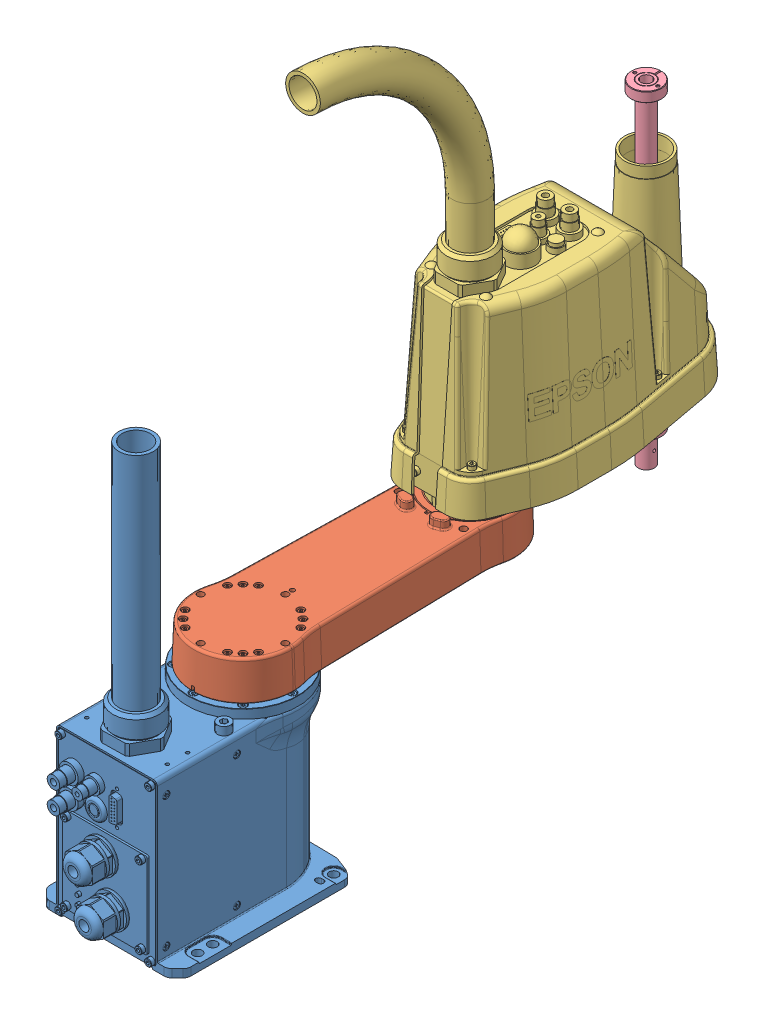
SolidWorks assembly LS3-401S_S_ASM.sldasm, configuration Default (file format 3800). Lengths in mm.
Overall size (140 650 615.85).
4 component instances, 4 part files, 9 mates.
Components (placement in the parent):
- LS3-BASE_S-1: LS3-BASE_S.sldprt [Default] at origin size (140 416.4 220.32)
- LS3-J1-1: LS3-J1.sldprt [Default] at origin size (99.59 54.01 319.62)
- LS3-J2-1: LS3-J2.sldprt [Default] at origin size (132.09 462 390.55)
- LS3-SHAFT_S-1: LS3-SHAFT_S.sldprt [Default] at origin size (30 330 29.98)
Mates (geometry in assembly coordinates):
- J1: planar angle = 1.570796 rad aligned: plane of ? through (0 0 0) normal (0 1 0); plane of ? through (0 0 0) normal (0 0 1)
- J2: planar angle aligned: plane of ? through (0 0 0) normal (0 0 1); plane of ? through (0 0 0) normal (0 0 1)
- J3: distance aligned: plane of ? through (0 0 144.5) normal (0 0 -1); plane of ? through (0 0 144.5) normal (0 0 -1)
- J4: planar angle aligned: plane of ? through (0 0 0) normal (0 1 0); plane of ? through (0 0 0) normal (0 1 0)
- Concentric1: concentric anti-aligned: cylinder of ?; cone of ?
- Distance2: unknown = 1 mm anti-aligned: unknown of ?; unknown of ?
- Concentric2: concentric anti-aligned: cylinder of ?; cone of ?
- Distance3: unknown = 11.9 mm anti-aligned: unknown of ?; unknown of ?
- Concentric3: concentric anti-aligned: cone of ?; cylinder of ?
